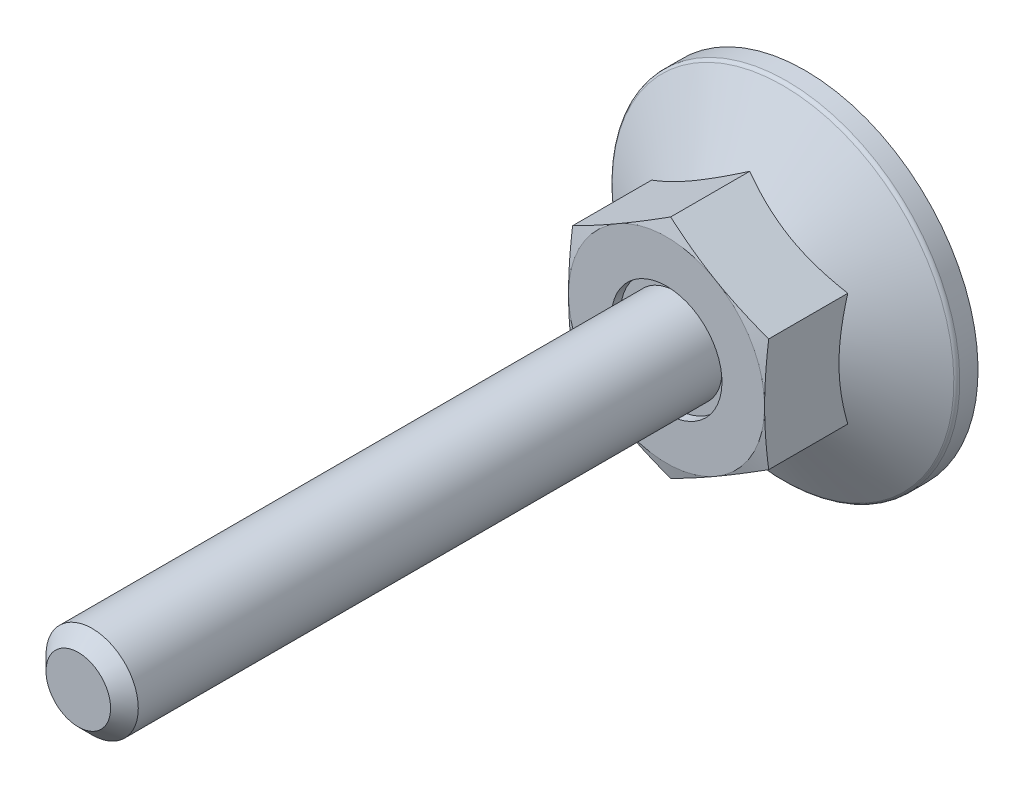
ISO-10303-21;
HEADER;
FILE_DESCRIPTION(('STEP AP214'),'2;1');
FILE_NAME('part.step','',(''),(''),'','','');
FILE_SCHEMA(('AUTOMOTIVE_DESIGN { 1 0 10303 214 1 1 1 1 }'));
ENDSEC;
DATA;
#1=APPLICATION_CONTEXT('core data for automotive mechanical design processes');
#2=APPLICATION_PROTOCOL_DEFINITION('international standard','automotive_design',2000,#1);
#3=PRODUCT_CONTEXT('',#1,'mechanical');
#4=PRODUCT('Part','Part','',(#3));
#5=PRODUCT_RELATED_PRODUCT_CATEGORY('part','',(#4));
#6=PRODUCT_DEFINITION_FORMATION('','',#4);
#7=PRODUCT_DEFINITION_CONTEXT('part definition',#1,'design');
#8=PRODUCT_DEFINITION('design','',#6,#7);
#9=PRODUCT_DEFINITION_SHAPE('','',#8);
#10=(LENGTH_UNIT() NAMED_UNIT(*) SI_UNIT(.MILLI.,.METRE.));
#11=(NAMED_UNIT(*) PLANE_ANGLE_UNIT() SI_UNIT($,.RADIAN.));
#12=(NAMED_UNIT(*) SI_UNIT($,.STERADIAN.) SOLID_ANGLE_UNIT());
#13=UNCERTAINTY_MEASURE_WITH_UNIT(LENGTH_MEASURE(1.E-05),#10,'distance_accuracy_value','');
#14=(GEOMETRIC_REPRESENTATION_CONTEXT(3) GLOBAL_UNCERTAINTY_ASSIGNED_CONTEXT((#13)) GLOBAL_UNIT_ASSIGNED_CONTEXT((#10,
#11,#12)) REPRESENTATION_CONTEXT('',''));
#15=CARTESIAN_POINT('',(0.,0.,0.));
#16=DIRECTION('',(0.,0.,1.));
#17=DIRECTION('',(1.,0.,0.));
#18=AXIS2_PLACEMENT_3D('',#15,#16,#17);
#19=CARTESIAN_POINT('',(0.,0.,11.2));
#20=DIRECTION('',(0.,0.,-1.));
#21=DIRECTION('',(0.,1.,0.));
#22=AXIS2_PLACEMENT_3D('',#19,#20,#21);
#23=PLANE('',#22);
#24=CARTESIAN_POINT('',(0.,0.,11.2));
#25=DIRECTION('',(0.,0.,-1.));
#26=DIRECTION('',(0.,1.,0.));
#27=AXIS2_PLACEMENT_3D('',#24,#25,#26);
#28=CIRCLE('',#27,4.8);
#29=CARTESIAN_POINT('',(0.,4.8,11.2));
#30=VERTEX_POINT('',#29);
#31=EDGE_CURVE('E108',#30,#30,#28,.T.);
#32=ORIENTED_EDGE('',*,*,#31,.F.);
#33=EDGE_LOOP('',(#32));
#34=FACE_BOUND('',#33,.T.);
#35=CARTESIAN_POINT('',(0.,0.,11.2));
#36=DIRECTION('',(0.,0.,-1.));
#37=DIRECTION('',(0.,1.,0.));
#38=AXIS2_PLACEMENT_3D('',#35,#36,#37);
#39=CIRCLE('',#38,4.);
#40=CARTESIAN_POINT('',(0.,4.,11.2));
#41=VERTEX_POINT('',#40);
#42=EDGE_CURVE('E259',#41,#41,#39,.F.);
#43=ORIENTED_EDGE('',*,*,#42,.F.);
#44=EDGE_LOOP('',(#43));
#45=FACE_BOUND('',#44,.T.);
#46=ADVANCED_FACE('F14',(#34,#45),#23,.F.);
#47=CARTESIAN_POINT('',(0.,9.81495457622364,32.));
#48=DIRECTION('',(0.5,-0.866025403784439,0.));
#49=DIRECTION('',(0.866025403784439,0.5,0.));
#50=AXIS2_PLACEMENT_3D('',#47,#48,#49);
#51=PLANE('',#50);
#52=CARTESIAN_POINT('',(-8.5002,4.90736181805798,4.7935207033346));
#53=CARTESIAN_POINT('',(-8.31336077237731,5.01523349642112,4.85579061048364));
#54=CARTESIAN_POINT('',(-8.1258249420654,5.1235073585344,4.91523445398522));
#55=CARTESIAN_POINT('',(-7.74923024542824,5.34093440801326,5.02769163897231));
#56=CARTESIAN_POINT('',(-7.56017075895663,5.45008795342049,5.08070220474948));
#57=CARTESIAN_POINT('',(-6.9899652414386,5.77929626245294,5.22904336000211));
#58=CARTESIAN_POINT('',(-6.60656835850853,6.00065055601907,5.31341782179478));
#59=CARTESIAN_POINT('',(-6.03282233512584,6.33190297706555,5.41235673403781));
#60=CARTESIAN_POINT('',(-5.84418723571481,6.44081150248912,5.44054155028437));
#61=CARTESIAN_POINT('',(-5.46606397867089,6.65912106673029,5.48780266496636));
#62=CARTESIAN_POINT('',(-5.27657589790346,6.76852206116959,5.5068797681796));
#63=CARTESIAN_POINT('',(-4.8972734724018,6.98751241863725,5.53544197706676));
#64=CARTESIAN_POINT('',(-4.70745974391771,7.09710142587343,5.54493796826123));
#65=CARTESIAN_POINT('',(-4.32765694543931,7.3163806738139,5.55413437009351));
#66=CARTESIAN_POINT('',(-4.13766788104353,7.42607091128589,5.55383508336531));
#67=CARTESIAN_POINT('',(-3.78247698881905,7.63114046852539,5.54412227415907));
#68=CARTESIAN_POINT('',(-3.6172500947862,7.72653426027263,5.53589358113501));
#69=CARTESIAN_POINT('',(-3.28718328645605,7.9170984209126,5.51218750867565));
#70=CARTESIAN_POINT('',(-3.12234339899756,8.01226877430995,5.49670964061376));
#71=CARTESIAN_POINT('',(-2.62846189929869,8.29741139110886,5.43976812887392));
#72=CARTESIAN_POINT('',(-2.30029449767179,8.48687892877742,5.38780368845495));
#73=CARTESIAN_POINT('',(-1.64047857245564,8.86782383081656,5.25789180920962));
#74=CARTESIAN_POINT('',(-1.30891425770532,9.05925257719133,5.17939367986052));
#75=CARTESIAN_POINT('',(-0.650730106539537,9.43925537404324,5.00123540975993));
#76=CARTESIAN_POINT('',(-0.32410184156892,9.62783429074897,4.90161711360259));
#77=CARTESIAN_POINT('',(0.000200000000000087,9.81507004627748,4.7935207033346));
#78=B_SPLINE_CURVE_WITH_KNOTS('',3,(#52,#53,#54,#55,#56,#57,#58,#59,#60,#61,#62,#63,#64,#65,#66,
#67,#68,#69,#70,#71,#72,#73,#74,#75,#76,#77),.UNSPECIFIED.,.F.,.F.,(4,2,2,2,2,2,2,2,2,2,2,2,4),
(0.,0.673596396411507,1.34748239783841,2.69805431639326,3.356799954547,4.01548737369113,
4.67342558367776,5.33134346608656,5.90409556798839,6.47688628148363,7.62328361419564,
8.79510569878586,9.9646274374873),.UNSPECIFIED.);
#79=CARTESIAN_POINT('',(-8.5,4.90747728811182,4.79358737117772));
#80=VERTEX_POINT('',#79);
#81=CARTESIAN_POINT('',(0.,9.81495457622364,4.79358737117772));
#82=VERTEX_POINT('',#81);
#83=EDGE_CURVE('E97',#80,#82,#78,.T.);
#84=ORIENTED_EDGE('',*,*,#83,.F.);
#85=DIRECTION('',(0.,0.,-1.));
#86=VECTOR('',#85,1.);
#87=CARTESIAN_POINT('',(-8.5,4.90747728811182,32.));
#88=LINE('',#87,#86);
#89=CARTESIAN_POINT('',(-8.5,4.90747728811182,11.6476589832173));
#90=VERTEX_POINT('',#89);
#91=EDGE_CURVE('E86',#90,#80,#88,.T.);
#92=ORIENTED_EDGE('',*,*,#91,.F.);
#93=CARTESIAN_POINT('',(0.000200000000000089,9.81507004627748,11.6476280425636));
#94=CARTESIAN_POINT('',(-0.352800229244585,9.61126526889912,11.7022599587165));
#95=CARTESIAN_POINT('',(-0.706440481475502,9.40709097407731,11.7518566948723));
#96=CARTESIAN_POINT('',(-1.41496987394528,8.99802133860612,11.8389934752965));
#97=CARTESIAN_POINT('',(-1.76985946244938,8.79312573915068,11.8765286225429));
#98=CARTESIAN_POINT('',(-2.47873586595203,8.38385575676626,11.9373509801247));
#99=CARTESIAN_POINT('',(-2.83271788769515,8.17948414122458,11.9607107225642));
#100=CARTESIAN_POINT('',(-3.5411333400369,7.77048028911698,11.9920337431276));
#101=CARTESIAN_POINT('',(-3.89556667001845,7.56584811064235,12.));
#102=CARTESIAN_POINT('',(-4.60443332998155,7.15658375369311,12.));
#103=CARTESIAN_POINT('',(-4.9588666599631,6.95195157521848,11.9920337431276));
#104=CARTESIAN_POINT('',(-5.66728211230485,6.54294772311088,11.9607107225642));
#105=CARTESIAN_POINT('',(-6.02126413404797,6.33857610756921,11.9373509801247));
#106=CARTESIAN_POINT('',(-6.73014053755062,5.92930612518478,11.8765286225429));
#107=CARTESIAN_POINT('',(-7.08503012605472,5.72441052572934,11.8389934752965));
#108=CARTESIAN_POINT('',(-7.7935595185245,5.31534089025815,11.7518566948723));
#109=CARTESIAN_POINT('',(-8.14719977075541,5.11116659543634,11.7022599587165));
#110=CARTESIAN_POINT('',(-8.5002,4.90736181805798,11.6476280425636));
#111=B_SPLINE_CURVE_WITH_KNOTS('',3,(#93,#94,#95,#96,#97,#98,#99,#100,#101,#102,#103,#104,#105,
#106,#107,#108,#109,#110),.UNSPECIFIED.,.F.,.F.,(4,2,2,2,2,2,2,2,4),(0.,1.23382789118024,
2.46815608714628,3.69611406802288,4.92383440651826,6.15155474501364,7.37951272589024,
8.61384092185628,9.84766881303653),.UNSPECIFIED.);
#112=CARTESIAN_POINT('',(-4.25,7.36121593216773,12.));
#113=VERTEX_POINT('',#112);
#114=EDGE_CURVE('E186',#113,#90,#111,.T.);
#115=ORIENTED_EDGE('',*,*,#114,.F.);
#116=CARTESIAN_POINT('',(0.,9.81495457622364,11.6476589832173));
#117=VERTEX_POINT('',#116);
#118=EDGE_CURVE('E318',#117,#113,#111,.T.);
#119=ORIENTED_EDGE('',*,*,#118,.F.);
#120=DIRECTION('',(0.,0.,-1.));
#121=VECTOR('',#120,1.);
#122=CARTESIAN_POINT('',(0.,9.81495457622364,32.));
#123=LINE('',#122,#121);
#124=EDGE_CURVE('E101',#117,#82,#123,.T.);
#125=ORIENTED_EDGE('',*,*,#124,.T.);
#126=EDGE_LOOP('',(#84,#92,#115,#119,#125));
#127=FACE_BOUND('',#126,.T.);
#128=ADVANCED_FACE('F100',(#127),#51,.F.);
#129=CARTESIAN_POINT('',(8.5,4.90747728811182,32.));
#130=DIRECTION('',(-0.5,-0.866025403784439,0.));
#131=DIRECTION('',(0.866025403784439,-0.5,0.));
#132=AXIS2_PLACEMENT_3D('',#129,#130,#131);
#133=PLANE('',#132);
#134=CARTESIAN_POINT('',(-0.0002,9.81507004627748,4.7935207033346));
#135=CARTESIAN_POINT('',(0.186639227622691,9.70719836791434,4.85579061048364));
#136=CARTESIAN_POINT('',(0.374175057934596,9.59892450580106,4.91523445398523));
#137=CARTESIAN_POINT('',(0.750769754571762,9.3814974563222,5.02769163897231));
#138=CARTESIAN_POINT('',(0.939829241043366,9.27234391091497,5.08070220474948));
#139=CARTESIAN_POINT('',(1.5100347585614,8.94313560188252,5.22904336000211));
#140=CARTESIAN_POINT('',(1.89343164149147,8.72178130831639,5.31341782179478));
#141=CARTESIAN_POINT('',(2.46717766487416,8.39052888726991,5.41235673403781));
#142=CARTESIAN_POINT('',(2.65581276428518,8.28162036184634,5.44054155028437));
#143=CARTESIAN_POINT('',(3.03393602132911,8.06331079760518,5.48780266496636));
#144=CARTESIAN_POINT('',(3.22342410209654,7.95390980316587,5.5068797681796));
#145=CARTESIAN_POINT('',(3.6027265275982,7.73491944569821,5.53544197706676));
#146=CARTESIAN_POINT('',(3.79254025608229,7.62533043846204,5.54493796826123));
#147=CARTESIAN_POINT('',(4.17234305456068,7.40605119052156,5.55413437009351));
#148=CARTESIAN_POINT('',(4.36233211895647,7.29636095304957,5.55383508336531));
#149=CARTESIAN_POINT('',(4.71752301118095,7.09129139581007,5.54412227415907));
#150=CARTESIAN_POINT('',(4.8827499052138,6.99589760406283,5.53589358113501));
#151=CARTESIAN_POINT('',(5.21281671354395,6.80533344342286,5.51218750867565));
#152=CARTESIAN_POINT('',(5.37765660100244,6.71016309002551,5.49670964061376));
#153=CARTESIAN_POINT('',(5.87153810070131,6.42502047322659,5.43976812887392));
#154=CARTESIAN_POINT('',(6.19970550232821,6.23555293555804,5.38780368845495));
#155=CARTESIAN_POINT('',(6.85952142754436,5.8546080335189,5.25789180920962));
#156=CARTESIAN_POINT('',(7.19108574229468,5.66317928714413,5.17939367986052));
#157=CARTESIAN_POINT('',(7.84926989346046,5.28317649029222,5.00123540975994));
#158=CARTESIAN_POINT('',(8.17589815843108,5.09459757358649,4.90161711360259));
#159=CARTESIAN_POINT('',(8.5002,4.90736181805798,4.7935207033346));
#160=B_SPLINE_CURVE_WITH_KNOTS('',3,(#134,#135,#136,#137,#138,#139,#140,#141,#142,#143,#144,
#145,#146,#147,#148,#149,#150,#151,#152,#153,#154,#155,#156,#157,#158,#159),.UNSPECIFIED.,.F.,
.F.,(4,2,2,2,2,2,2,2,2,2,2,2,4),(0.,0.673596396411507,1.34748239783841,2.69805431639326,
3.356799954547,4.01548737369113,4.67342558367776,5.33134346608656,5.90409556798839,
6.47688628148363,7.62328361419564,8.79510569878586,9.9646274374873),.UNSPECIFIED.);
#161=CARTESIAN_POINT('',(8.5,4.90747728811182,4.79358737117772));
#162=VERTEX_POINT('',#161);
#163=EDGE_CURVE('E29',#82,#162,#160,.T.);
#164=ORIENTED_EDGE('',*,*,#163,.F.);
#165=ORIENTED_EDGE('',*,*,#124,.F.);
#166=CARTESIAN_POINT('',(8.5002,4.90736181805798,11.6476280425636));
#167=CARTESIAN_POINT('',(8.14719977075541,5.11116659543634,11.7022599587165));
#168=CARTESIAN_POINT('',(7.7935595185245,5.31534089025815,11.7518566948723));
#169=CARTESIAN_POINT('',(7.08503012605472,5.72441052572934,11.8389934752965));
#170=CARTESIAN_POINT('',(6.73014053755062,5.92930612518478,11.8765286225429));
#171=CARTESIAN_POINT('',(6.02126413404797,6.33857610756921,11.9373509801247));
#172=CARTESIAN_POINT('',(5.66728211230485,6.54294772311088,11.9607107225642));
#173=CARTESIAN_POINT('',(4.9588666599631,6.95195157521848,11.9920337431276));
#174=CARTESIAN_POINT('',(4.60443332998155,7.15658375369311,12.));
#175=CARTESIAN_POINT('',(3.89556667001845,7.56584811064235,12.));
#176=CARTESIAN_POINT('',(3.5411333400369,7.77048028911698,11.9920337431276));
#177=CARTESIAN_POINT('',(2.83271788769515,8.17948414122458,11.9607107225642));
#178=CARTESIAN_POINT('',(2.47873586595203,8.38385575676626,11.9373509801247));
#179=CARTESIAN_POINT('',(1.76985946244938,8.79312573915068,11.8765286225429));
#180=CARTESIAN_POINT('',(1.41496987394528,8.99802133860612,11.8389934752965));
#181=CARTESIAN_POINT('',(0.706440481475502,9.40709097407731,11.7518566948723));
#182=CARTESIAN_POINT('',(0.352800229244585,9.61126526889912,11.7022599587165));
#183=CARTESIAN_POINT('',(-0.000200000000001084,9.81507004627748,11.6476280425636));
#184=B_SPLINE_CURVE_WITH_KNOTS('',3,(#166,#167,#168,#169,#170,#171,#172,#173,#174,#175,#176,
#177,#178,#179,#180,#181,#182,#183),.UNSPECIFIED.,.F.,.F.,(4,2,2,2,2,2,2,2,4),(0.,
1.23382789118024,2.46815608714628,3.69611406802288,4.92383440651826,6.15155474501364,
7.37951272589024,8.61384092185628,9.84766881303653),.UNSPECIFIED.);
#185=CARTESIAN_POINT('',(4.25,7.36121593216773,12.));
#186=VERTEX_POINT('',#185);
#187=EDGE_CURVE('E177',#186,#117,#184,.T.);
#188=ORIENTED_EDGE('',*,*,#187,.F.);
#189=CARTESIAN_POINT('',(8.5,4.90747728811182,11.6476589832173));
#190=VERTEX_POINT('',#189);
#191=EDGE_CURVE('E184',#190,#186,#184,.T.);
#192=ORIENTED_EDGE('',*,*,#191,.F.);
#193=DIRECTION('',(0.,0.,-1.));
#194=VECTOR('',#193,1.);
#195=CARTESIAN_POINT('',(8.5,4.90747728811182,32.));
#196=LINE('',#195,#194);
#197=EDGE_CURVE('E216',#190,#162,#196,.T.);
#198=ORIENTED_EDGE('',*,*,#197,.T.);
#199=EDGE_LOOP('',(#164,#165,#188,#192,#198));
#200=FACE_BOUND('',#199,.T.);
#201=ADVANCED_FACE('F192',(#200),#133,.F.);
#202=CARTESIAN_POINT('',(8.5,-4.90747728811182,32.));
#203=DIRECTION('',(-1.,0.,0.));
#204=DIRECTION('',(0.,-1.,0.));
#205=AXIS2_PLACEMENT_3D('',#202,#203,#204);
#206=PLANE('',#205);
#207=CARTESIAN_POINT('',(8.5,13.0314294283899,1.47752704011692));
#208=CARTESIAN_POINT('',(8.5,12.6612665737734,1.65647774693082));
#209=CARTESIAN_POINT('',(8.5,12.290237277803,1.83366776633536));
#210=CARTESIAN_POINT('',(8.5,11.5459841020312,2.1835324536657));
#211=CARTESIAN_POINT('',(8.5,11.1727598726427,2.3562063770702));
#212=CARTESIAN_POINT('',(8.5,10.4216603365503,2.69694543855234));
#213=CARTESIAN_POINT('',(8.5,10.0437706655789,2.86497902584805));
#214=CARTESIAN_POINT('',(8.5,9.2849306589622,3.19396010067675));
#215=CARTESIAN_POINT('',(8.5,8.90398047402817,3.35490793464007));
#216=CARTESIAN_POINT('',(8.5,8.12702308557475,3.67249615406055));
#217=CARTESIAN_POINT('',(8.5,7.73090483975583,3.82886642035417));
#218=CARTESIAN_POINT('',(8.5,6.93398073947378,4.12940330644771));
#219=CARTESIAN_POINT('',(8.5,6.53317435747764,4.27356853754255));
#220=CARTESIAN_POINT('',(8.5,5.72703031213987,4.54580160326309));
#221=CARTESIAN_POINT('',(8.5,5.32170421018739,4.67390329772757));
#222=CARTESIAN_POINT('',(8.5,4.50525785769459,4.90980359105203));
#223=CARTESIAN_POINT('',(8.5,4.09413952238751,5.01760873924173));
#224=CARTESIAN_POINT('',(8.5,3.26789885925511,5.20711197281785));
#225=CARTESIAN_POINT('',(8.5,2.85280627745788,5.28893618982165));
#226=CARTESIAN_POINT('',(8.5,2.22651264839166,5.38853539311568));
#227=CARTESIAN_POINT('',(8.5,2.01712321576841,5.41788026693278));
#228=CARTESIAN_POINT('',(8.5,1.59735566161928,5.46827917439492));
#229=CARTESIAN_POINT('',(8.5,1.38697763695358,5.48933400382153));
#230=CARTESIAN_POINT('',(8.5,0.968196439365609,5.52247691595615));
#231=CARTESIAN_POINT('',(8.5,0.759802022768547,5.53467524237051));
#232=CARTESIAN_POINT('',(8.5,0.342684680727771,5.55026003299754));
#233=CARTESIAN_POINT('',(8.5,0.133961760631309,5.5536466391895));
#234=CARTESIAN_POINT('',(8.5,-0.283445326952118,5.55152742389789));
#235=CARTESIAN_POINT('',(8.5,-0.492129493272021,5.546021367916));
#236=CARTESIAN_POINT('',(8.5,-0.909085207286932,5.52624824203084));
#237=CARTESIAN_POINT('',(8.5,-1.11735673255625,5.51198070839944));
#238=CARTESIAN_POINT('',(8.5,-1.62231800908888,5.46706351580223));
#239=CARTESIAN_POINT('',(8.5,-1.91862399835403,5.43201243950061));
#240=CARTESIAN_POINT('',(8.5,-2.50892471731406,5.34612267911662));
#241=CARTESIAN_POINT('',(8.5,-2.80291910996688,5.29528173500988));
#242=CARTESIAN_POINT('',(8.5,-3.68114216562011,5.12178025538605));
#243=CARTESIAN_POINT('',(8.5,-4.26128126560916,4.97817413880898));
#244=CARTESIAN_POINT('',(8.5,-5.12903133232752,4.73045572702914));
#245=CARTESIAN_POINT('',(8.5,-5.42116721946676,4.64129591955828));
#246=CARTESIAN_POINT('',(8.5,-6.0025970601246,4.45406394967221));
#247=CARTESIAN_POINT('',(8.5,-6.29189099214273,4.35599171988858));
#248=CARTESIAN_POINT('',(8.5,-6.86774141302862,4.15248019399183));
#249=CARTESIAN_POINT('',(8.5,-7.15429879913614,4.0470434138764));
#250=CARTESIAN_POINT('',(8.5,-7.72505625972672,3.83000899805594));
#251=CARTESIAN_POINT('',(8.5,-8.00925638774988,3.71841150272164));
#252=CARTESIAN_POINT('',(8.5,-8.7865968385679,3.40502511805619));
#253=CARTESIAN_POINT('',(8.5,-9.2776226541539,3.197996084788));
#254=CARTESIAN_POINT('',(8.5,-10.2546964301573,2.77246752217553));
#255=CARTESIAN_POINT('',(8.5,-10.7407438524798,2.55396676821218));
#256=CARTESIAN_POINT('',(8.5,-11.7090438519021,2.108282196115));
#257=CARTESIAN_POINT('',(8.5,-12.1912949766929,1.88109523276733));
#258=CARTESIAN_POINT('',(8.5,-13.1526185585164,1.42016244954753));
#259=CARTESIAN_POINT('',(8.5,-13.6316911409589,1.18641689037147));
#260=CARTESIAN_POINT('',(8.5,-14.588034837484,0.713462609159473));
#261=CARTESIAN_POINT('',(8.5,-15.0653020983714,0.47424611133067));
#262=CARTESIAN_POINT('',(8.5,-16.0177905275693,-0.00822936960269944));
#263=CARTESIAN_POINT('',(8.5,-16.4930116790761,-0.251488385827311));
#264=CARTESIAN_POINT('',(8.5,-17.4416812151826,-0.741191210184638));
#265=CARTESIAN_POINT('',(8.5,-17.9151299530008,-0.987634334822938));
#266=CARTESIAN_POINT('',(8.5,-18.8606492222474,-1.48315179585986));
#267=CARTESIAN_POINT('',(8.5,-19.3327197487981,-1.73222614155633));
#268=CARTESIAN_POINT('',(8.5,-20.6461392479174,-2.42904815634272));
#269=CARTESIAN_POINT('',(8.5,-21.4862394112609,-2.87914918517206));
#270=CARTESIAN_POINT('',(8.5,-23.1638169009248,-3.78432075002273));
#271=CARTESIAN_POINT('',(8.5,-24.0012940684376,-4.23939157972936));
#272=CARTESIAN_POINT('',(8.5,-25.671623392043,-5.15180725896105));
#273=CARTESIAN_POINT('',(8.5,-26.5044818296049,-5.60914061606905));
#274=CARTESIAN_POINT('',(8.5,-27.7525740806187,-6.29723391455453));
#275=CARTESIAN_POINT('',(8.5,-28.1683903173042,-6.52693873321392));
#276=CARTESIAN_POINT('',(8.5,-28.9996764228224,-6.98697325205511));
#277=CARTESIAN_POINT('',(8.5,-29.4151462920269,-7.21730295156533));
#278=CARTESIAN_POINT('',(8.5,-29.8304643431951,-7.44790614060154));
#279=B_SPLINE_CURVE_WITH_KNOTS('',3,(#207,#208,#209,#210,#211,#212,#213,#214,#215,#216,#217,
#218,#219,#220,#221,#222,#223,#224,#225,#226,#227,#228,#229,#230,#231,#232,#233,#234,#235,#236,
#237,#238,#239,#240,#241,#242,#243,#244,#245,#246,#247,#248,#249,#250,#251,#252,#253,#254,#255,
#256,#257,#258,#259,#260,#261,#262,#263,#264,#265,#266,#267,#268,#269,#270,#271,#272,#273,#274,
#275,#276,#277,#278),.UNSPECIFIED.,.F.,.F.,(4,2,2,2,2,2,2,2,2,2,2,2,2,2,2,2,2,2,2,2,2,2,2,2,2,2,
2,2,2,2,2,2,2,2,2,4),(0.,1.23346428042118,2.46713064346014,3.70776702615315,4.94834268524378,
6.22578289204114,7.5033682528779,8.77821366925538,10.0526470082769,11.32079515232,
11.9549638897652,12.5890717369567,13.2151443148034,13.8412068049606,14.4672858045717,
15.0933979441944,15.9880059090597,16.8827419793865,18.6732029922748,19.5894472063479,
20.5056983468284,21.4216379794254,22.3375567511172,23.9359919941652,25.5345982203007,
27.1337888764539,28.7329160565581,30.3344778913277,31.9360528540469,33.5372895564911,
35.1385319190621,37.9977422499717,40.8571224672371,43.7075995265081,45.1327331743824,
46.5578652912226),.UNSPECIFIED.);
#280=CARTESIAN_POINT('',(8.5,-4.90747728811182,4.79358737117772));
#281=VERTEX_POINT('',#280);
#282=EDGE_CURVE('E37',#162,#281,#279,.T.);
#283=ORIENTED_EDGE('',*,*,#282,.F.);
#284=ORIENTED_EDGE('',*,*,#197,.F.);
#285=CARTESIAN_POINT('',(8.5,12.9820891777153,10.1197370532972));
#286=CARTESIAN_POINT('',(8.5,12.5964686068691,10.2061594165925));
#287=CARTESIAN_POINT('',(8.5,12.2106068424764,10.2915248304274));
#288=CARTESIAN_POINT('',(8.5,11.4382824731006,10.4595712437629));
#289=CARTESIAN_POINT('',(8.5,11.0518198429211,10.5422521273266));
#290=CARTESIAN_POINT('',(8.5,10.2778290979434,10.7044309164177));
#291=CARTESIAN_POINT('',(8.5,9.89030030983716,10.7839256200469));
#292=CARTESIAN_POINT('',(8.5,9.11443612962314,10.9388739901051));
#293=CARTESIAN_POINT('',(8.5,8.72610074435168,11.0143276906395));
#294=CARTESIAN_POINT('',(8.5,7.95158013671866,11.159650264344));
#295=CARTESIAN_POINT('',(8.5,7.56540239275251,11.2295587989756));
#296=CARTESIAN_POINT('',(8.5,6.79199352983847,11.3632725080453));
#297=CARTESIAN_POINT('',(8.5,6.40476243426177,11.4270778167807));
#298=CARTESIAN_POINT('',(8.5,5.62917169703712,11.54714843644));
#299=CARTESIAN_POINT('',(8.5,5.24081220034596,11.6034146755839));
#300=CARTESIAN_POINT('',(8.5,4.46285737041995,11.70674908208));
#301=CARTESIAN_POINT('',(8.5,4.07326203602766,11.7538172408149));
#302=CARTESIAN_POINT('',(8.5,3.28844017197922,11.8374226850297));
#303=CARTESIAN_POINT('',(8.5,2.89320002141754,11.8738340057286));
#304=CARTESIAN_POINT('',(8.5,2.10172608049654,11.9336139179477));
#305=CARTESIAN_POINT('',(8.5,1.70549231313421,11.9569828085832));
#306=CARTESIAN_POINT('',(8.5,0.91260591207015,11.9893148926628));
#307=CARTESIAN_POINT('',(8.5,0.515953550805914,11.9982846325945));
#308=CARTESIAN_POINT('',(8.5,-0.277408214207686,12.0012669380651));
#309=CARTESIAN_POINT('',(8.5,-0.674117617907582,11.9952795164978));
#310=CARTESIAN_POINT('',(8.5,-1.46847963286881,11.9686842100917));
#311=CARTESIAN_POINT('',(8.5,-1.86613043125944,11.9480232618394));
#312=CARTESIAN_POINT('',(8.5,-2.66049684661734,11.8932602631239));
#313=CARTESIAN_POINT('',(8.5,-3.05721244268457,11.8591579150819));
#314=CARTESIAN_POINT('',(8.5,-3.84970511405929,11.7792347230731));
#315=CARTESIAN_POINT('',(8.5,-4.24548140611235,11.7334062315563));
#316=CARTESIAN_POINT('',(8.5,-5.03576028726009,11.6319377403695));
#317=CARTESIAN_POINT('',(8.5,-5.43026287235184,11.5762977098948));
#318=CARTESIAN_POINT('',(8.5,-6.19195385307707,11.4609360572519));
#319=CARTESIAN_POINT('',(8.5,-6.55922094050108,11.4017287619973));
#320=CARTESIAN_POINT('',(8.5,-7.29278719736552,11.2775674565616));
#321=CARTESIAN_POINT('',(8.5,-7.65908634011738,11.2126132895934));
#322=CARTESIAN_POINT('',(8.5,-8.39085027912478,11.078008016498));
#323=CARTESIAN_POINT('',(8.5,-8.75631499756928,11.0083564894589));
#324=CARTESIAN_POINT('',(8.5,-9.48649515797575,10.8652200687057));
#325=CARTESIAN_POINT('',(8.5,-9.85121059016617,10.7917351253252));
#326=CARTESIAN_POINT('',(8.5,-10.5800753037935,10.6416087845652));
#327=CARTESIAN_POINT('',(8.5,-10.944224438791,10.5649666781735));
#328=CARTESIAN_POINT('',(8.5,-11.6719684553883,10.4090909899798));
#329=CARTESIAN_POINT('',(8.5,-12.0355633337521,10.3298573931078));
#330=CARTESIAN_POINT('',(8.5,-13.1255915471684,10.0889686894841));
#331=CARTESIAN_POINT('',(8.5,-13.8513178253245,9.92411536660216));
#332=CARTESIAN_POINT('',(8.5,-15.2942598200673,9.59010912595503));
#333=CARTESIAN_POINT('',(8.5,-16.0114890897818,9.42101437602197));
#334=CARTESIAN_POINT('',(8.5,-17.4449475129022,9.07858755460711));
#335=CARTESIAN_POINT('',(8.5,-18.1611766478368,8.90525540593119));
#336=CARTESIAN_POINT('',(8.5,-19.5919856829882,8.5556799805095));
#337=CARTESIAN_POINT('',(8.5,-20.306566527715,8.37944056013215));
#338=CARTESIAN_POINT('',(8.5,-21.7351057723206,8.02455520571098));
#339=CARTESIAN_POINT('',(8.5,-22.4490641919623,7.8459093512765));
#340=CARTESIAN_POINT('',(8.5,-23.1628057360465,7.66641079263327));
#341=B_SPLINE_CURVE_WITH_KNOTS('',3,(#285,#286,#287,#288,#289,#290,#291,#292,#293,#294,#295,
#296,#297,#298,#299,#300,#301,#302,#303,#304,#305,#306,#307,#308,#309,#310,#311,#312,#313,#314,
#315,#316,#317,#318,#319,#320,#321,#322,#323,#324,#325,#326,#327,#328,#329,#330,#331,#332,#333,
#334,#335,#336,#337,#338,#339,#340),.UNSPECIFIED.,.F.,.F.,(4,2,2,2,2,2,2,2,2,2,2,2,2,2,2,2,2,2,
2,2,2,2,2,2,2,2,2,4),(0.,1.18556310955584,2.37117735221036,3.55795462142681,4.74472187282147,
5.92204594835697,7.09934411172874,8.27649719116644,9.45365137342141,10.6442044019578,
11.8347301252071,13.0247144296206,14.2146977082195,15.4090063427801,16.6033414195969,
17.7984574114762,18.9935771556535,20.1095500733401,21.2255534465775,22.3416569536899,
23.4577749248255,24.5741449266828,25.6905214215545,27.9231231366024,30.1337863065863,
32.3444897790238,34.5524651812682,36.7603677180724),.UNSPECIFIED.);
#342=CARTESIAN_POINT('',(8.5,0.,12.));
#343=VERTEX_POINT('',#342);
#344=EDGE_CURVE('E170',#343,#190,#341,.F.);
#345=ORIENTED_EDGE('',*,*,#344,.F.);
#346=CARTESIAN_POINT('',(8.5,-4.90747728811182,11.6476589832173));
#347=VERTEX_POINT('',#346);
#348=EDGE_CURVE('E185',#347,#343,#341,.F.);
#349=ORIENTED_EDGE('',*,*,#348,.F.);
#350=DIRECTION('',(0.,0.,-1.));
#351=VECTOR('',#350,1.);
#352=CARTESIAN_POINT('',(8.5,-4.90747728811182,32.));
#353=LINE('',#352,#351);
#354=EDGE_CURVE('E218',#347,#281,#353,.T.);
#355=ORIENTED_EDGE('',*,*,#354,.T.);
#356=EDGE_LOOP('',(#283,#284,#345,#349,#355));
#357=FACE_BOUND('',#356,.T.);
#358=ADVANCED_FACE('F195',(#357),#206,.F.);
#359=CARTESIAN_POINT('',(0.,-9.81495457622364,32.));
#360=DIRECTION('',(-0.5,0.866025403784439,0.));
#361=DIRECTION('',(-0.866025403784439,-0.5,0.));
#362=AXIS2_PLACEMENT_3D('',#359,#360,#361);
#363=PLANE('',#362);
#364=CARTESIAN_POINT('',(8.5002,-4.90736181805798,4.7935207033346));
#365=CARTESIAN_POINT('',(8.31336077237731,-5.01523349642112,4.85579061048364));
#366=CARTESIAN_POINT('',(8.1258249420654,-5.1235073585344,4.91523445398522));
#367=CARTESIAN_POINT('',(7.74923024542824,-5.34093440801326,5.02769163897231));
#368=CARTESIAN_POINT('',(7.56017075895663,-5.45008795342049,5.08070220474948));
#369=CARTESIAN_POINT('',(6.9899652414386,-5.77929626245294,5.22904336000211));
#370=CARTESIAN_POINT('',(6.60656835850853,-6.00065055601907,5.31341782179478));
#371=CARTESIAN_POINT('',(6.03282233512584,-6.33190297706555,5.41235673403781));
#372=CARTESIAN_POINT('',(5.84418723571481,-6.44081150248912,5.44054155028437));
#373=CARTESIAN_POINT('',(5.46606397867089,-6.65912106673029,5.48780266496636));
#374=CARTESIAN_POINT('',(5.27657589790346,-6.76852206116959,5.5068797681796));
#375=CARTESIAN_POINT('',(4.8972734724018,-6.98751241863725,5.53544197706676));
#376=CARTESIAN_POINT('',(4.70745974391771,-7.09710142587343,5.54493796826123));
#377=CARTESIAN_POINT('',(4.32765694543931,-7.3163806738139,5.55413437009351));
#378=CARTESIAN_POINT('',(4.13766788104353,-7.42607091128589,5.55383508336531));
#379=CARTESIAN_POINT('',(3.78247698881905,-7.63114046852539,5.54412227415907));
#380=CARTESIAN_POINT('',(3.6172500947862,-7.72653426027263,5.53589358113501));
#381=CARTESIAN_POINT('',(3.28718328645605,-7.9170984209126,5.51218750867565));
#382=CARTESIAN_POINT('',(3.12234339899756,-8.01226877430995,5.49670964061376));
#383=CARTESIAN_POINT('',(2.62846189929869,-8.29741139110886,5.43976812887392));
#384=CARTESIAN_POINT('',(2.30029449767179,-8.48687892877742,5.38780368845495));
#385=CARTESIAN_POINT('',(1.64047857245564,-8.86782383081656,5.25789180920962));
#386=CARTESIAN_POINT('',(1.30891425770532,-9.05925257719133,5.17939367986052));
#387=CARTESIAN_POINT('',(0.650730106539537,-9.43925537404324,5.00123540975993));
#388=CARTESIAN_POINT('',(0.32410184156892,-9.62783429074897,4.90161711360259));
#389=CARTESIAN_POINT('',(-0.000200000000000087,-9.81507004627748,4.7935207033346));
#390=B_SPLINE_CURVE_WITH_KNOTS('',3,(#364,#365,#366,#367,#368,#369,#370,#371,#372,#373,#374,
#375,#376,#377,#378,#379,#380,#381,#382,#383,#384,#385,#386,#387,#388,#389),.UNSPECIFIED.,.F.,
.F.,(4,2,2,2,2,2,2,2,2,2,2,2,4),(0.,0.673596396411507,1.34748239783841,2.69805431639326,
3.356799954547,4.01548737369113,4.67342558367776,5.33134346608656,5.90409556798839,
6.47688628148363,7.62328361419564,8.79510569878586,9.9646274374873),.UNSPECIFIED.);
#391=CARTESIAN_POINT('',(0.,-9.81495457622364,4.79358737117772));
#392=VERTEX_POINT('',#391);
#393=EDGE_CURVE('E276',#281,#392,#390,.T.);
#394=ORIENTED_EDGE('',*,*,#393,.F.);
#395=ORIENTED_EDGE('',*,*,#354,.F.);
#396=CARTESIAN_POINT('',(-0.000200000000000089,-9.81507004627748,11.6476280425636));
#397=CARTESIAN_POINT('',(0.352800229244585,-9.61126526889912,11.7022599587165));
#398=CARTESIAN_POINT('',(0.706440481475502,-9.40709097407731,11.7518566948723));
#399=CARTESIAN_POINT('',(1.41496987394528,-8.99802133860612,11.8389934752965));
#400=CARTESIAN_POINT('',(1.76985946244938,-8.79312573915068,11.8765286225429));
#401=CARTESIAN_POINT('',(2.47873586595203,-8.38385575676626,11.9373509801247));
#402=CARTESIAN_POINT('',(2.83271788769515,-8.17948414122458,11.9607107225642));
#403=CARTESIAN_POINT('',(3.5411333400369,-7.77048028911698,11.9920337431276));
#404=CARTESIAN_POINT('',(3.89556667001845,-7.56584811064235,12.));
#405=CARTESIAN_POINT('',(4.60443332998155,-7.15658375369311,12.));
#406=CARTESIAN_POINT('',(4.9588666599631,-6.95195157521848,11.9920337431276));
#407=CARTESIAN_POINT('',(5.66728211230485,-6.54294772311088,11.9607107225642));
#408=CARTESIAN_POINT('',(6.02126413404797,-6.33857610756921,11.9373509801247));
#409=CARTESIAN_POINT('',(6.73014053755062,-5.92930612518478,11.8765286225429));
#410=CARTESIAN_POINT('',(7.08503012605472,-5.72441052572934,11.8389934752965));
#411=CARTESIAN_POINT('',(7.7935595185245,-5.31534089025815,11.7518566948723));
#412=CARTESIAN_POINT('',(8.14719977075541,-5.11116659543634,11.7022599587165));
#413=CARTESIAN_POINT('',(8.5002,-4.90736181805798,11.6476280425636));
#414=B_SPLINE_CURVE_WITH_KNOTS('',3,(#396,#397,#398,#399,#400,#401,#402,#403,#404,#405,#406,
#407,#408,#409,#410,#411,#412,#413),.UNSPECIFIED.,.F.,.F.,(4,2,2,2,2,2,2,2,4),(0.,
1.23382789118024,2.46815608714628,3.69611406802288,4.92383440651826,6.15155474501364,
7.37951272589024,8.61384092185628,9.84766881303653),.UNSPECIFIED.);
#415=CARTESIAN_POINT('',(4.25,-7.36121593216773,12.));
#416=VERTEX_POINT('',#415);
#417=EDGE_CURVE('E164',#416,#347,#414,.T.);
#418=ORIENTED_EDGE('',*,*,#417,.F.);
#419=CARTESIAN_POINT('',(0.,-9.81495457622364,11.6476589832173));
#420=VERTEX_POINT('',#419);
#421=EDGE_CURVE('E299',#420,#416,#414,.T.);
#422=ORIENTED_EDGE('',*,*,#421,.F.);
#423=DIRECTION('',(0.,0.,-1.));
#424=VECTOR('',#423,1.);
#425=CARTESIAN_POINT('',(0.,-9.81495457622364,32.));
#426=LINE('',#425,#424);
#427=EDGE_CURVE('E220',#420,#392,#426,.T.);
#428=ORIENTED_EDGE('',*,*,#427,.T.);
#429=EDGE_LOOP('',(#394,#395,#418,#422,#428));
#430=FACE_BOUND('',#429,.T.);
#431=ADVANCED_FACE('F281',(#430),#363,.F.);
#432=CARTESIAN_POINT('',(-8.5,-4.90747728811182,32.));
#433=DIRECTION('',(0.5,0.866025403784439,0.));
#434=DIRECTION('',(-0.866025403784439,0.5,0.));
#435=AXIS2_PLACEMENT_3D('',#432,#433,#434);
#436=PLANE('',#435);
#437=CARTESIAN_POINT('',(0.0002,-9.81507004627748,4.7935207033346));
#438=CARTESIAN_POINT('',(-0.186639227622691,-9.70719836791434,4.85579061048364));
#439=CARTESIAN_POINT('',(-0.374175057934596,-9.59892450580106,4.91523445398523));
#440=CARTESIAN_POINT('',(-0.750769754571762,-9.3814974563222,5.02769163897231));
#441=CARTESIAN_POINT('',(-0.939829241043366,-9.27234391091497,5.08070220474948));
#442=CARTESIAN_POINT('',(-1.5100347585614,-8.94313560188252,5.22904336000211));
#443=CARTESIAN_POINT('',(-1.89343164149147,-8.72178130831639,5.31341782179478));
#444=CARTESIAN_POINT('',(-2.46717766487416,-8.39052888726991,5.41235673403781));
#445=CARTESIAN_POINT('',(-2.65581276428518,-8.28162036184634,5.44054155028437));
#446=CARTESIAN_POINT('',(-3.03393602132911,-8.06331079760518,5.48780266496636));
#447=CARTESIAN_POINT('',(-3.22342410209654,-7.95390980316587,5.5068797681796));
#448=CARTESIAN_POINT('',(-3.6027265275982,-7.73491944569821,5.53544197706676));
#449=CARTESIAN_POINT('',(-3.79254025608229,-7.62533043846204,5.54493796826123));
#450=CARTESIAN_POINT('',(-4.17234305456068,-7.40605119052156,5.55413437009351));
#451=CARTESIAN_POINT('',(-4.36233211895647,-7.29636095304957,5.55383508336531));
#452=CARTESIAN_POINT('',(-4.71752301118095,-7.09129139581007,5.54412227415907));
#453=CARTESIAN_POINT('',(-4.8827499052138,-6.99589760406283,5.53589358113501));
#454=CARTESIAN_POINT('',(-5.21281671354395,-6.80533344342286,5.51218750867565));
#455=CARTESIAN_POINT('',(-5.37765660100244,-6.71016309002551,5.49670964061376));
#456=CARTESIAN_POINT('',(-5.87153810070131,-6.42502047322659,5.43976812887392));
#457=CARTESIAN_POINT('',(-6.19970550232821,-6.23555293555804,5.38780368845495));
#458=CARTESIAN_POINT('',(-6.85952142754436,-5.8546080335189,5.25789180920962));
#459=CARTESIAN_POINT('',(-7.19108574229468,-5.66317928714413,5.17939367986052));
#460=CARTESIAN_POINT('',(-7.84926989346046,-5.28317649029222,5.00123540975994));
#461=CARTESIAN_POINT('',(-8.17589815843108,-5.09459757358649,4.90161711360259));
#462=CARTESIAN_POINT('',(-8.5002,-4.90736181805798,4.7935207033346));
#463=B_SPLINE_CURVE_WITH_KNOTS('',3,(#437,#438,#439,#440,#441,#442,#443,#444,#445,#446,#447,
#448,#449,#450,#451,#452,#453,#454,#455,#456,#457,#458,#459,#460,#461,#462),.UNSPECIFIED.,.F.,
.F.,(4,2,2,2,2,2,2,2,2,2,2,2,4),(0.,0.673596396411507,1.34748239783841,2.69805431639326,
3.356799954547,4.01548737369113,4.67342558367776,5.33134346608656,5.90409556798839,
6.47688628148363,7.62328361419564,8.79510569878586,9.9646274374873),.UNSPECIFIED.);
#464=CARTESIAN_POINT('',(-8.5,-4.90747728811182,4.79358737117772));
#465=VERTEX_POINT('',#464);
#466=EDGE_CURVE('E107',#392,#465,#463,.T.);
#467=ORIENTED_EDGE('',*,*,#466,.F.);
#468=ORIENTED_EDGE('',*,*,#427,.F.);
#469=CARTESIAN_POINT('',(-8.5002,-4.90736181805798,11.6476280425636));
#470=CARTESIAN_POINT('',(-8.14719977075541,-5.11116659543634,11.7022599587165));
#471=CARTESIAN_POINT('',(-7.7935595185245,-5.31534089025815,11.7518566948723));
#472=CARTESIAN_POINT('',(-7.08503012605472,-5.72441052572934,11.8389934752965));
#473=CARTESIAN_POINT('',(-6.73014053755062,-5.92930612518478,11.8765286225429));
#474=CARTESIAN_POINT('',(-6.02126413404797,-6.33857610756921,11.9373509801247));
#475=CARTESIAN_POINT('',(-5.66728211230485,-6.54294772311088,11.9607107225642));
#476=CARTESIAN_POINT('',(-4.9588666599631,-6.95195157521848,11.9920337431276));
#477=CARTESIAN_POINT('',(-4.60443332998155,-7.15658375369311,12.));
#478=CARTESIAN_POINT('',(-3.89556667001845,-7.56584811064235,12.));
#479=CARTESIAN_POINT('',(-3.5411333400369,-7.77048028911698,11.9920337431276));
#480=CARTESIAN_POINT('',(-2.83271788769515,-8.17948414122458,11.9607107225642));
#481=CARTESIAN_POINT('',(-2.47873586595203,-8.38385575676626,11.9373509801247));
#482=CARTESIAN_POINT('',(-1.76985946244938,-8.79312573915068,11.8765286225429));
#483=CARTESIAN_POINT('',(-1.41496987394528,-8.99802133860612,11.8389934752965));
#484=CARTESIAN_POINT('',(-0.706440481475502,-9.40709097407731,11.7518566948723));
#485=CARTESIAN_POINT('',(-0.352800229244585,-9.61126526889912,11.7022599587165));
#486=CARTESIAN_POINT('',(0.000200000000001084,-9.81507004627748,11.6476280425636));
#487=B_SPLINE_CURVE_WITH_KNOTS('',3,(#469,#470,#471,#472,#473,#474,#475,#476,#477,#478,#479,
#480,#481,#482,#483,#484,#485,#486),.UNSPECIFIED.,.F.,.F.,(4,2,2,2,2,2,2,2,4),(0.,
1.23382789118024,2.46815608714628,3.69611406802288,4.92383440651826,6.15155474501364,
7.37951272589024,8.61384092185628,9.84766881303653),.UNSPECIFIED.);
#488=CARTESIAN_POINT('',(-4.25,-7.36121593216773,12.));
#489=VERTEX_POINT('',#488);
#490=EDGE_CURVE('E144',#489,#420,#487,.T.);
#491=ORIENTED_EDGE('',*,*,#490,.F.);
#492=CARTESIAN_POINT('',(-8.5,-4.90747728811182,11.6476589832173));
#493=VERTEX_POINT('',#492);
#494=EDGE_CURVE('E226',#493,#489,#487,.T.);
#495=ORIENTED_EDGE('',*,*,#494,.F.);
#496=DIRECTION('',(0.,0.,-1.));
#497=VECTOR('',#496,1.);
#498=CARTESIAN_POINT('',(-8.5,-4.90747728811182,32.));
#499=LINE('',#498,#497);
#500=EDGE_CURVE('E96',#493,#465,#499,.T.);
#501=ORIENTED_EDGE('',*,*,#500,.T.);
#502=EDGE_LOOP('',(#467,#468,#491,#495,#501));
#503=FACE_BOUND('',#502,.T.);
#504=ADVANCED_FACE('F129',(#503),#436,.F.);
#505=CARTESIAN_POINT('',(-8.5,4.90747728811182,32.));
#506=DIRECTION('',(1.,0.,0.));
#507=DIRECTION('',(0.,1.,0.));
#508=AXIS2_PLACEMENT_3D('',#505,#506,#507);
#509=PLANE('',#508);
#510=CARTESIAN_POINT('',(-8.5,13.0314294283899,1.47752704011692));
#511=CARTESIAN_POINT('',(-8.5,12.6612665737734,1.65647774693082));
#512=CARTESIAN_POINT('',(-8.5,12.290237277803,1.83366776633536));
#513=CARTESIAN_POINT('',(-8.5,11.5459841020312,2.1835324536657));
#514=CARTESIAN_POINT('',(-8.5,11.1727598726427,2.3562063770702));
#515=CARTESIAN_POINT('',(-8.5,10.4216603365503,2.69694543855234));
#516=CARTESIAN_POINT('',(-8.5,10.0437706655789,2.86497902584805));
#517=CARTESIAN_POINT('',(-8.5,9.2849306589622,3.19396010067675));
#518=CARTESIAN_POINT('',(-8.5,8.90398047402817,3.35490793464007));
#519=CARTESIAN_POINT('',(-8.5,8.12702308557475,3.67249615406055));
#520=CARTESIAN_POINT('',(-8.5,7.73090483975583,3.82886642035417));
#521=CARTESIAN_POINT('',(-8.5,6.93398073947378,4.12940330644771));
#522=CARTESIAN_POINT('',(-8.5,6.53317435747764,4.27356853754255));
#523=CARTESIAN_POINT('',(-8.5,5.72703031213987,4.54580160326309));
#524=CARTESIAN_POINT('',(-8.5,5.32170421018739,4.67390329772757));
#525=CARTESIAN_POINT('',(-8.5,4.50525785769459,4.90980359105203));
#526=CARTESIAN_POINT('',(-8.5,4.09413952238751,5.01760873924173));
#527=CARTESIAN_POINT('',(-8.5,3.26789885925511,5.20711197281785));
#528=CARTESIAN_POINT('',(-8.5,2.85280627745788,5.28893618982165));
#529=CARTESIAN_POINT('',(-8.5,2.22651264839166,5.38853539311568));
#530=CARTESIAN_POINT('',(-8.5,2.01712321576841,5.41788026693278));
#531=CARTESIAN_POINT('',(-8.5,1.59735566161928,5.46827917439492));
#532=CARTESIAN_POINT('',(-8.5,1.38697763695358,5.48933400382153));
#533=CARTESIAN_POINT('',(-8.5,0.968196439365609,5.52247691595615));
#534=CARTESIAN_POINT('',(-8.5,0.759802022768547,5.53467524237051));
#535=CARTESIAN_POINT('',(-8.5,0.342684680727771,5.55026003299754));
#536=CARTESIAN_POINT('',(-8.5,0.133961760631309,5.5536466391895));
#537=CARTESIAN_POINT('',(-8.5,-0.283445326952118,5.55152742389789));
#538=CARTESIAN_POINT('',(-8.5,-0.492129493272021,5.546021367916));
#539=CARTESIAN_POINT('',(-8.5,-0.909085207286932,5.52624824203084));
#540=CARTESIAN_POINT('',(-8.5,-1.11735673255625,5.51198070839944));
#541=CARTESIAN_POINT('',(-8.5,-1.62231800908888,5.46706351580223));
#542=CARTESIAN_POINT('',(-8.5,-1.91862399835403,5.43201243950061));
#543=CARTESIAN_POINT('',(-8.5,-2.50892471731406,5.34612267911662));
#544=CARTESIAN_POINT('',(-8.5,-2.80291910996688,5.29528173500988));
#545=CARTESIAN_POINT('',(-8.5,-3.68114216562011,5.12178025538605));
#546=CARTESIAN_POINT('',(-8.5,-4.26128126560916,4.97817413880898));
#547=CARTESIAN_POINT('',(-8.5,-5.12903133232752,4.73045572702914));
#548=CARTESIAN_POINT('',(-8.5,-5.42116721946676,4.64129591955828));
#549=CARTESIAN_POINT('',(-8.5,-6.0025970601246,4.45406394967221));
#550=CARTESIAN_POINT('',(-8.5,-6.29189099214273,4.35599171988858));
#551=CARTESIAN_POINT('',(-8.5,-6.86774141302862,4.15248019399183));
#552=CARTESIAN_POINT('',(-8.5,-7.15429879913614,4.0470434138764));
#553=CARTESIAN_POINT('',(-8.5,-7.72505625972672,3.83000899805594));
#554=CARTESIAN_POINT('',(-8.5,-8.00925638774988,3.71841150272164));
#555=CARTESIAN_POINT('',(-8.5,-8.7865968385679,3.40502511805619));
#556=CARTESIAN_POINT('',(-8.5,-9.2776226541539,3.197996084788));
#557=CARTESIAN_POINT('',(-8.5,-10.2546964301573,2.77246752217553));
#558=CARTESIAN_POINT('',(-8.5,-10.7407438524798,2.55396676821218));
#559=CARTESIAN_POINT('',(-8.5,-11.7090438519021,2.108282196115));
#560=CARTESIAN_POINT('',(-8.5,-12.1912949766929,1.88109523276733));
#561=CARTESIAN_POINT('',(-8.5,-13.1526185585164,1.42016244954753));
#562=CARTESIAN_POINT('',(-8.5,-13.6316911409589,1.18641689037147));
#563=CARTESIAN_POINT('',(-8.5,-14.588034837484,0.713462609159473));
#564=CARTESIAN_POINT('',(-8.5,-15.0653020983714,0.47424611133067));
#565=CARTESIAN_POINT('',(-8.5,-16.0177905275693,-0.00822936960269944));
#566=CARTESIAN_POINT('',(-8.5,-16.4930116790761,-0.251488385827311));
#567=CARTESIAN_POINT('',(-8.5,-17.4416812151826,-0.741191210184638));
#568=CARTESIAN_POINT('',(-8.5,-17.9151299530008,-0.987634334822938));
#569=CARTESIAN_POINT('',(-8.5,-18.8606492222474,-1.48315179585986));
#570=CARTESIAN_POINT('',(-8.5,-19.3327197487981,-1.73222614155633));
#571=CARTESIAN_POINT('',(-8.5,-20.6461392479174,-2.42904815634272));
#572=CARTESIAN_POINT('',(-8.5,-21.4862394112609,-2.87914918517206));
#573=CARTESIAN_POINT('',(-8.5,-23.1638169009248,-3.78432075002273));
#574=CARTESIAN_POINT('',(-8.5,-24.0012940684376,-4.23939157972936));
#575=CARTESIAN_POINT('',(-8.5,-25.671623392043,-5.15180725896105));
#576=CARTESIAN_POINT('',(-8.5,-26.5044818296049,-5.60914061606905));
#577=CARTESIAN_POINT('',(-8.5,-27.7525740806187,-6.29723391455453));
#578=CARTESIAN_POINT('',(-8.5,-28.1683903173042,-6.52693873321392));
#579=CARTESIAN_POINT('',(-8.5,-28.9996764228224,-6.98697325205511));
#580=CARTESIAN_POINT('',(-8.5,-29.4151462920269,-7.21730295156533));
#581=CARTESIAN_POINT('',(-8.5,-29.8304643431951,-7.44790614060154));
#582=B_SPLINE_CURVE_WITH_KNOTS('',3,(#510,#511,#512,#513,#514,#515,#516,#517,#518,#519,#520,
#521,#522,#523,#524,#525,#526,#527,#528,#529,#530,#531,#532,#533,#534,#535,#536,#537,#538,#539,
#540,#541,#542,#543,#544,#545,#546,#547,#548,#549,#550,#551,#552,#553,#554,#555,#556,#557,#558,
#559,#560,#561,#562,#563,#564,#565,#566,#567,#568,#569,#570,#571,#572,#573,#574,#575,#576,#577,
#578,#579,#580,#581),.UNSPECIFIED.,.F.,.F.,(4,2,2,2,2,2,2,2,2,2,2,2,2,2,2,2,2,2,2,2,2,2,2,2,2,2,
2,2,2,2,2,2,2,2,2,4),(0.,1.23346428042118,2.46713064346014,3.70776702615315,4.94834268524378,
6.22578289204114,7.5033682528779,8.77821366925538,10.0526470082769,11.32079515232,
11.9549638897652,12.5890717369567,13.2151443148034,13.8412068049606,14.4672858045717,
15.0933979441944,15.9880059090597,16.8827419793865,18.6732029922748,19.5894472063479,
20.5056983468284,21.4216379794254,22.3375567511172,23.9359919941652,25.5345982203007,
27.1337888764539,28.7329160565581,30.3344778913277,31.9360528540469,33.5372895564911,
35.1385319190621,37.9977422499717,40.8571224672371,43.7075995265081,45.1327331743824,
46.5578652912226),.UNSPECIFIED.);
#583=EDGE_CURVE('E90',#465,#80,#582,.F.);
#584=ORIENTED_EDGE('',*,*,#583,.F.);
#585=ORIENTED_EDGE('',*,*,#500,.F.);
#586=CARTESIAN_POINT('',(-8.5,12.9820891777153,10.1197370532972));
#587=CARTESIAN_POINT('',(-8.5,12.5964686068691,10.2061594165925));
#588=CARTESIAN_POINT('',(-8.5,12.2106068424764,10.2915248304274));
#589=CARTESIAN_POINT('',(-8.5,11.4382824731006,10.4595712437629));
#590=CARTESIAN_POINT('',(-8.5,11.0518198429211,10.5422521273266));
#591=CARTESIAN_POINT('',(-8.5,10.2778290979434,10.7044309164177));
#592=CARTESIAN_POINT('',(-8.5,9.89030030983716,10.7839256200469));
#593=CARTESIAN_POINT('',(-8.5,9.11443612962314,10.9388739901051));
#594=CARTESIAN_POINT('',(-8.5,8.72610074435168,11.0143276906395));
#595=CARTESIAN_POINT('',(-8.5,7.95158013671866,11.159650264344));
#596=CARTESIAN_POINT('',(-8.5,7.56540239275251,11.2295587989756));
#597=CARTESIAN_POINT('',(-8.5,6.79199352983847,11.3632725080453));
#598=CARTESIAN_POINT('',(-8.5,6.40476243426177,11.4270778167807));
#599=CARTESIAN_POINT('',(-8.5,5.62917169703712,11.54714843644));
#600=CARTESIAN_POINT('',(-8.5,5.24081220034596,11.6034146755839));
#601=CARTESIAN_POINT('',(-8.5,4.46285737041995,11.70674908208));
#602=CARTESIAN_POINT('',(-8.5,4.07326203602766,11.7538172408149));
#603=CARTESIAN_POINT('',(-8.5,3.28844017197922,11.8374226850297));
#604=CARTESIAN_POINT('',(-8.5,2.89320002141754,11.8738340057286));
#605=CARTESIAN_POINT('',(-8.5,2.10172608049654,11.9336139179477));
#606=CARTESIAN_POINT('',(-8.5,1.70549231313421,11.9569828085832));
#607=CARTESIAN_POINT('',(-8.5,0.91260591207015,11.9893148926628));
#608=CARTESIAN_POINT('',(-8.5,0.515953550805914,11.9982846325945));
#609=CARTESIAN_POINT('',(-8.5,-0.277408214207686,12.0012669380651));
#610=CARTESIAN_POINT('',(-8.5,-0.674117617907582,11.9952795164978));
#611=CARTESIAN_POINT('',(-8.5,-1.46847963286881,11.9686842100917));
#612=CARTESIAN_POINT('',(-8.5,-1.86613043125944,11.9480232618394));
#613=CARTESIAN_POINT('',(-8.5,-2.66049684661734,11.8932602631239));
#614=CARTESIAN_POINT('',(-8.5,-3.05721244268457,11.8591579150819));
#615=CARTESIAN_POINT('',(-8.5,-3.84970511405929,11.7792347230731));
#616=CARTESIAN_POINT('',(-8.5,-4.24548140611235,11.7334062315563));
#617=CARTESIAN_POINT('',(-8.5,-5.03576028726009,11.6319377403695));
#618=CARTESIAN_POINT('',(-8.5,-5.43026287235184,11.5762977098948));
#619=CARTESIAN_POINT('',(-8.5,-6.19195385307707,11.4609360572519));
#620=CARTESIAN_POINT('',(-8.5,-6.55922094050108,11.4017287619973));
#621=CARTESIAN_POINT('',(-8.5,-7.29278719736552,11.2775674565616));
#622=CARTESIAN_POINT('',(-8.5,-7.65908634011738,11.2126132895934));
#623=CARTESIAN_POINT('',(-8.5,-8.39085027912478,11.078008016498));
#624=CARTESIAN_POINT('',(-8.5,-8.75631499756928,11.0083564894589));
#625=CARTESIAN_POINT('',(-8.5,-9.48649515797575,10.8652200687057));
#626=CARTESIAN_POINT('',(-8.5,-9.85121059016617,10.7917351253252));
#627=CARTESIAN_POINT('',(-8.5,-10.5800753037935,10.6416087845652));
#628=CARTESIAN_POINT('',(-8.5,-10.944224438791,10.5649666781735));
#629=CARTESIAN_POINT('',(-8.5,-11.6719684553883,10.4090909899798));
#630=CARTESIAN_POINT('',(-8.5,-12.0355633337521,10.3298573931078));
#631=CARTESIAN_POINT('',(-8.5,-13.1255915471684,10.0889686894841));
#632=CARTESIAN_POINT('',(-8.5,-13.8513178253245,9.92411536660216));
#633=CARTESIAN_POINT('',(-8.5,-15.2942598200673,9.59010912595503));
#634=CARTESIAN_POINT('',(-8.5,-16.0114890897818,9.42101437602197));
#635=CARTESIAN_POINT('',(-8.5,-17.4449475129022,9.07858755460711));
#636=CARTESIAN_POINT('',(-8.5,-18.1611766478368,8.90525540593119));
#637=CARTESIAN_POINT('',(-8.5,-19.5919856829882,8.5556799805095));
#638=CARTESIAN_POINT('',(-8.5,-20.306566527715,8.37944056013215));
#639=CARTESIAN_POINT('',(-8.5,-21.7351057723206,8.02455520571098));
#640=CARTESIAN_POINT('',(-8.5,-22.4490641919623,7.8459093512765));
#641=CARTESIAN_POINT('',(-8.5,-23.1628057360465,7.66641079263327));
#642=B_SPLINE_CURVE_WITH_KNOTS('',3,(#586,#587,#588,#589,#590,#591,#592,#593,#594,#595,#596,
#597,#598,#599,#600,#601,#602,#603,#604,#605,#606,#607,#608,#609,#610,#611,#612,#613,#614,#615,
#616,#617,#618,#619,#620,#621,#622,#623,#624,#625,#626,#627,#628,#629,#630,#631,#632,#633,#634,
#635,#636,#637,#638,#639,#640,#641),.UNSPECIFIED.,.F.,.F.,(4,2,2,2,2,2,2,2,2,2,2,2,2,2,2,2,2,2,
2,2,2,2,2,2,2,2,2,4),(0.,1.18556310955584,2.37117735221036,3.55795462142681,4.74472187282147,
5.92204594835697,7.09934411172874,8.27649719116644,9.45365137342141,10.6442044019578,
11.8347301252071,13.0247144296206,14.2146977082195,15.4090063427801,16.6033414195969,
17.7984574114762,18.9935771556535,20.1095500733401,21.2255534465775,22.3416569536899,
23.4577749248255,24.5741449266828,25.6905214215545,27.9231231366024,30.1337863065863,
32.3444897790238,34.5524651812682,36.7603677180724),.UNSPECIFIED.);
#643=CARTESIAN_POINT('',(-8.5,0.,12.));
#644=VERTEX_POINT('',#643);
#645=EDGE_CURVE('E136',#644,#493,#642,.T.);
#646=ORIENTED_EDGE('',*,*,#645,.F.);
#647=EDGE_CURVE('E93',#90,#644,#642,.T.);
#648=ORIENTED_EDGE('',*,*,#647,.F.);
#649=ORIENTED_EDGE('',*,*,#91,.T.);
#650=EDGE_LOOP('',(#584,#585,#646,#648,#649));
#651=FACE_BOUND('',#650,.T.);
#652=ADVANCED_FACE('F88',(#651),#509,.F.);
#653=CARTESIAN_POINT('',(0.,0.,12.));
#654=DIRECTION('',(0.,0.,-1.));
#655=DIRECTION('',(0.,1.,0.));
#656=AXIS2_PLACEMENT_3D('',#653,#654,#655);
#657=CONICAL_SURFACE('',#656,8.5,1.30899693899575);
#658=ORIENTED_EDGE('',*,*,#417,.T.);
#659=ORIENTED_EDGE('',*,*,#348,.T.);
#660=CARTESIAN_POINT('',(0.,0.,12.));
#661=DIRECTION('',(0.,0.,-1.));
#662=DIRECTION('',(0.,1.,0.));
#663=AXIS2_PLACEMENT_3D('',#660,#661,#662);
#664=CIRCLE('',#663,8.5);
#665=EDGE_CURVE('E244',#343,#416,#664,.T.);
#666=ORIENTED_EDGE('',*,*,#665,.T.);
#667=EDGE_LOOP('',(#658,#659,#666));
#668=FACE_BOUND('',#667,.T.);
#669=ADVANCED_FACE('F128',(#668),#657,.T.);
#670=EDGE_CURVE('E246',#186,#343,#664,.T.);
#671=ORIENTED_EDGE('',*,*,#670,.T.);
#672=ORIENTED_EDGE('',*,*,#344,.T.);
#673=ORIENTED_EDGE('',*,*,#191,.T.);
#674=EDGE_LOOP('',(#671,#672,#673));
#675=FACE_BOUND('',#674,.T.);
#676=ADVANCED_FACE('F307',(#675),#657,.T.);
#677=EDGE_CURVE('E242',#113,#186,#664,.T.);
#678=ORIENTED_EDGE('',*,*,#677,.T.);
#679=ORIENTED_EDGE('',*,*,#187,.T.);
#680=ORIENTED_EDGE('',*,*,#118,.T.);
#681=EDGE_LOOP('',(#678,#679,#680));
#682=FACE_BOUND('',#681,.T.);
#683=ADVANCED_FACE('F312',(#682),#657,.T.);
#684=ORIENTED_EDGE('',*,*,#490,.T.);
#685=ORIENTED_EDGE('',*,*,#421,.T.);
#686=EDGE_CURVE('E243',#416,#489,#664,.T.);
#687=ORIENTED_EDGE('',*,*,#686,.T.);
#688=EDGE_LOOP('',(#684,#685,#687));
#689=FACE_BOUND('',#688,.T.);
#690=ADVANCED_FACE('F305',(#689),#657,.T.);
#691=EDGE_CURVE('E231',#644,#113,#664,.T.);
#692=ORIENTED_EDGE('',*,*,#691,.T.);
#693=ORIENTED_EDGE('',*,*,#114,.T.);
#694=ORIENTED_EDGE('',*,*,#647,.T.);
#695=EDGE_LOOP('',(#692,#693,#694));
#696=FACE_BOUND('',#695,.T.);
#697=ADVANCED_FACE('F156',(#696),#657,.T.);
#698=CARTESIAN_POINT('',(0.,0.,0.));
#699=DIRECTION('',(0.,0.,-1.));
#700=DIRECTION('',(0.,1.,0.));
#701=AXIS2_PLACEMENT_3D('',#698,#699,#700);
#702=CYLINDRICAL_SURFACE('',#701,4.8);
#703=CARTESIAN_POINT('',(0.,0.,12.));
#704=DIRECTION('',(0.,0.,-1.));
#705=DIRECTION('',(0.,1.,0.));
#706=AXIS2_PLACEMENT_3D('',#703,#704,#705);
#707=CIRCLE('',#706,4.8);
#708=CARTESIAN_POINT('',(0.,4.8,12.));
#709=VERTEX_POINT('',#708);
#710=EDGE_CURVE('E112',#709,#709,#707,.T.);
#711=ORIENTED_EDGE('',*,*,#710,.F.);
#712=EDGE_LOOP('',(#711));
#713=FACE_BOUND('',#712,.T.);
#714=ORIENTED_EDGE('',*,*,#31,.T.);
#715=EDGE_LOOP('',(#714));
#716=FACE_BOUND('',#715,.T.);
#717=ADVANCED_FACE('F250',(#713,#716),#702,.F.);
#718=CARTESIAN_POINT('',(4.8,0.,12.));
#719=DIRECTION('',(0.,0.,-1.));
#720=DIRECTION('',(0.,1.,0.));
#721=AXIS2_PLACEMENT_3D('',#718,#719,#720);
#722=PLANE('',#721);
#723=ORIENTED_EDGE('',*,*,#665,.F.);
#724=ORIENTED_EDGE('',*,*,#670,.F.);
#725=ORIENTED_EDGE('',*,*,#677,.F.);
#726=ORIENTED_EDGE('',*,*,#691,.F.);
#727=EDGE_CURVE('E238',#489,#644,#664,.T.);
#728=ORIENTED_EDGE('',*,*,#727,.F.);
#729=ORIENTED_EDGE('',*,*,#686,.F.);
#730=EDGE_LOOP('',(#723,#724,#725,#726,#728,#729));
#731=FACE_BOUND('',#730,.T.);
#732=ORIENTED_EDGE('',*,*,#710,.T.);
#733=EDGE_LOOP('',(#732));
#734=FACE_BOUND('',#733,.T.);
#735=ADVANCED_FACE('F154',(#731,#734),#722,.F.);
#736=ORIENTED_EDGE('',*,*,#645,.T.);
#737=ORIENTED_EDGE('',*,*,#494,.T.);
#738=ORIENTED_EDGE('',*,*,#727,.T.);
#739=EDGE_LOOP('',(#736,#737,#738));
#740=FACE_BOUND('',#739,.T.);
#741=ADVANCED_FACE('F150',(#740),#657,.T.);
#742=CARTESIAN_POINT('',(0.,0.,10.4602540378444));
#743=DIRECTION('',(0.,0.,-1.));
#744=DIRECTION('',(0.,1.,0.));
#745=AXIS2_PLACEMENT_3D('',#742,#743,#744);
#746=CONICAL_SURFACE('',#745,0.,1.0471975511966);
#747=CARTESIAN_POINT('',(0.,0.,1.90825317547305));
#748=DIRECTION('',(0.,0.,-1.));
#749=DIRECTION('',(0.,1.,0.));
#750=AXIS2_PLACEMENT_3D('',#747,#748,#749);
#751=CIRCLE('',#750,14.8125);
#752=CARTESIAN_POINT('',(0.,14.8125,1.90825317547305));
#753=VERTEX_POINT('',#752);
#754=EDGE_CURVE('E269',#753,#753,#751,.T.);
#755=ORIENTED_EDGE('',*,*,#754,.F.);
#756=EDGE_LOOP('',(#755));
#757=FACE_BOUND('',#756,.T.);
#758=ORIENTED_EDGE('',*,*,#583,.T.);
#759=ORIENTED_EDGE('',*,*,#83,.T.);
#760=ORIENTED_EDGE('',*,*,#163,.T.);
#761=ORIENTED_EDGE('',*,*,#282,.T.);
#762=ORIENTED_EDGE('',*,*,#393,.T.);
#763=ORIENTED_EDGE('',*,*,#466,.T.);
#764=EDGE_LOOP('',(#758,#759,#760,#761,#762,#763));
#765=FACE_BOUND('',#764,.T.);
#766=ADVANCED_FACE('F105',(#757,#765),#746,.T.);
#767=CARTESIAN_POINT('',(0.,0.,1.58349364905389));
#768=DIRECTION('',(0.,0.,-1.));
#769=DIRECTION('',(0.,1.,0.));
#770=AXIS2_PLACEMENT_3D('',#767,#768,#769);
#771=TOROIDAL_SURFACE('',#770,14.625,0.375);
#772=ORIENTED_EDGE('',*,*,#754,.T.);
#773=EDGE_LOOP('',(#772));
#774=FACE_BOUND('',#773,.T.);
#775=CARTESIAN_POINT('',(0.,0.,1.58349365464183));
#776=DIRECTION('',(0.,0.,-1.));
#777=DIRECTION('',(0.,1.,0.));
#778=AXIS2_PLACEMENT_3D('',#775,#776,#777);
#779=CIRCLE('',#778,15.);
#780=CARTESIAN_POINT('',(0.,15.,1.58349365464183));
#781=VERTEX_POINT('',#780);
#782=EDGE_CURVE('E264',#781,#781,#779,.T.);
#783=ORIENTED_EDGE('',*,*,#782,.F.);
#784=EDGE_LOOP('',(#783));
#785=FACE_BOUND('',#784,.T.);
#786=ADVANCED_FACE('F360',(#774,#785),#771,.T.);
#787=CARTESIAN_POINT('',(0.,0.,0.));
#788=DIRECTION('',(0.,0.,-1.));
#789=DIRECTION('',(0.,1.,0.));
#790=AXIS2_PLACEMENT_3D('',#787,#788,#789);
#791=CYLINDRICAL_SURFACE('',#790,15.);
#792=CARTESIAN_POINT('',(0.,0.,0.));
#793=DIRECTION('',(0.,0.,-1.));
#794=DIRECTION('',(0.,1.,0.));
#795=AXIS2_PLACEMENT_3D('',#792,#793,#794);
#796=CIRCLE('',#795,15.);
#797=CARTESIAN_POINT('',(0.,15.,0.));
#798=VERTEX_POINT('',#797);
#799=EDGE_CURVE('E261',#798,#798,#796,.T.);
#800=ORIENTED_EDGE('',*,*,#799,.F.);
#801=EDGE_LOOP('',(#800));
#802=FACE_BOUND('',#801,.T.);
#803=ORIENTED_EDGE('',*,*,#782,.T.);
#804=EDGE_LOOP('',(#803));
#805=FACE_BOUND('',#804,.T.);
#806=ADVANCED_FACE('F368',(#802,#805),#791,.T.);
#807=CARTESIAN_POINT('',(10.2,0.,0.));
#808=DIRECTION('',(0.,0.,1.));
#809=DIRECTION('',(0.,-1.,0.));
#810=AXIS2_PLACEMENT_3D('',#807,#808,#809);
#811=PLANE('',#810);
#812=ORIENTED_EDGE('',*,*,#799,.T.);
#813=EDGE_LOOP('',(#812));
#814=FACE_BOUND('',#813,.T.);
#815=ADVANCED_FACE('F132',(#814),#811,.F.);
#816=CARTESIAN_POINT('',(0.,0.,0.));
#817=DIRECTION('',(0.,0.,-1.));
#818=DIRECTION('',(0.,1.,0.));
#819=AXIS2_PLACEMENT_3D('',#816,#817,#818);
#820=CYLINDRICAL_SURFACE('',#819,4.);
#821=CARTESIAN_POINT('',(0.,0.,61.8));
#822=DIRECTION('',(0.,0.,1.));
#823=DIRECTION('',(0.,-1.,0.));
#824=AXIS2_PLACEMENT_3D('',#821,#822,#823);
#825=CIRCLE('',#824,4.);
#826=CARTESIAN_POINT('',(0.,-4.,61.8));
#827=VERTEX_POINT('',#826);
#828=EDGE_CURVE('E9',#827,#827,#825,.F.);
#829=ORIENTED_EDGE('',*,*,#828,.T.);
#830=EDGE_LOOP('',(#829));
#831=FACE_BOUND('',#830,.T.);
#832=ORIENTED_EDGE('',*,*,#42,.T.);
#833=EDGE_LOOP('',(#832));
#834=FACE_BOUND('',#833,.T.);
#835=ADVANCED_FACE('F384',(#831,#834),#820,.T.);
#836=CARTESIAN_POINT('',(0.,0.,63.));
#837=DIRECTION('',(0.,0.,1.));
#838=DIRECTION('',(0.,-1.,0.));
#839=AXIS2_PLACEMENT_3D('',#836,#837,#838);
#840=PLANE('',#839);
#841=CARTESIAN_POINT('',(0.,0.,63.));
#842=DIRECTION('',(0.,0.,1.));
#843=DIRECTION('',(0.,-1.,0.));
#844=AXIS2_PLACEMENT_3D('',#841,#842,#843);
#845=CIRCLE('',#844,2.8);
#846=CARTESIAN_POINT('',(0.,-2.8,63.));
#847=VERTEX_POINT('',#846);
#848=EDGE_CURVE('E22',#847,#847,#845,.T.);
#849=ORIENTED_EDGE('',*,*,#848,.T.);
#850=EDGE_LOOP('',(#849));
#851=FACE_BOUND('',#850,.T.);
#852=ADVANCED_FACE('F392',(#851),#840,.T.);
#853=CARTESIAN_POINT('',(0.,0.,63.));
#854=DIRECTION('',(0.,0.,-1.));
#855=DIRECTION('',(0.,1.,0.));
#856=AXIS2_PLACEMENT_3D('',#853,#854,#855);
#857=CONICAL_SURFACE('',#856,2.8,0.78539816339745);
#858=ORIENTED_EDGE('',*,*,#828,.F.);
#859=EDGE_LOOP('',(#858));
#860=FACE_BOUND('',#859,.T.);
#861=ORIENTED_EDGE('',*,*,#848,.F.);
#862=EDGE_LOOP('',(#861));
#863=FACE_BOUND('',#862,.T.);
#864=ADVANCED_FACE('F16',(#860,#863),#857,.T.);
#865=CLOSED_SHELL('',(#46,#128,#201,#358,#431,#504,#652,#669,#676,#683,#690,#697,#717,#735,#741,
#766,#786,#806,#815,#835,#852,#864));
#866=MANIFOLD_SOLID_BREP('B1',#865);
#867=ADVANCED_BREP_SHAPE_REPRESENTATION('',(#18,#866),#14);
#868=SHAPE_DEFINITION_REPRESENTATION(#9,#867);
ENDSEC;
END-ISO-10303-21;
